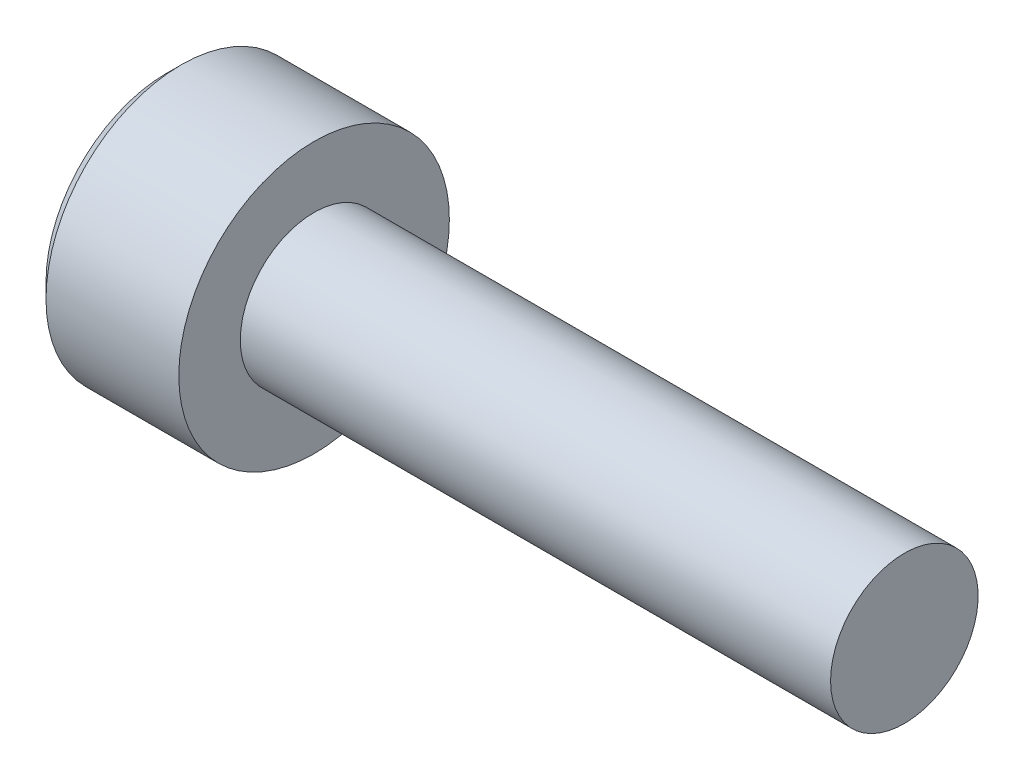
ISO-10303-21;
HEADER;
FILE_DESCRIPTION(('STEP AP214'),'2;1');
FILE_NAME('part.step','',(''),(''),'','','');
FILE_SCHEMA(('AUTOMOTIVE_DESIGN { 1 0 10303 214 1 1 1 1 }'));
ENDSEC;
DATA;
#1=APPLICATION_CONTEXT('core data for automotive mechanical design processes');
#2=APPLICATION_PROTOCOL_DEFINITION('international standard','automotive_design',2000,#1);
#3=PRODUCT_CONTEXT('',#1,'mechanical');
#4=PRODUCT('Part','Part','',(#3));
#5=PRODUCT_RELATED_PRODUCT_CATEGORY('part','',(#4));
#6=PRODUCT_DEFINITION_FORMATION('','',#4);
#7=PRODUCT_DEFINITION_CONTEXT('part definition',#1,'design');
#8=PRODUCT_DEFINITION('design','',#6,#7);
#9=PRODUCT_DEFINITION_SHAPE('','',#8);
#10=(LENGTH_UNIT() NAMED_UNIT(*) SI_UNIT(.MILLI.,.METRE.));
#11=(NAMED_UNIT(*) PLANE_ANGLE_UNIT() SI_UNIT($,.RADIAN.));
#12=(NAMED_UNIT(*) SI_UNIT($,.STERADIAN.) SOLID_ANGLE_UNIT());
#13=UNCERTAINTY_MEASURE_WITH_UNIT(LENGTH_MEASURE(1.E-05),#10,'distance_accuracy_value','');
#14=(GEOMETRIC_REPRESENTATION_CONTEXT(3) GLOBAL_UNCERTAINTY_ASSIGNED_CONTEXT((#13)) GLOBAL_UNIT_ASSIGNED_CONTEXT((#10,
#11,#12)) REPRESENTATION_CONTEXT('',''));
#15=CARTESIAN_POINT('',(0.,0.,0.));
#16=DIRECTION('',(0.,0.,1.));
#17=DIRECTION('',(1.,0.,0.));
#18=AXIS2_PLACEMENT_3D('',#15,#16,#17);
#19=CARTESIAN_POINT('',(-3.,2.75,0.));
#20=DIRECTION('',(1.,0.,0.));
#21=DIRECTION('',(0.,0.,-1.));
#22=AXIS2_PLACEMENT_3D('',#19,#20,#21);
#23=PLANE('',#22);
#24=CARTESIAN_POINT('',(-3.,0.,0.));
#25=DIRECTION('',(1.,0.,0.));
#26=DIRECTION('',(0.,0.,-1.));
#27=AXIS2_PLACEMENT_3D('',#24,#25,#26);
#28=CIRCLE('',#27,2.45);
#29=CARTESIAN_POINT('',(-3.,0.,-2.45));
#30=VERTEX_POINT('',#29);
#31=EDGE_CURVE('E45',#30,#30,#28,.F.);
#32=ORIENTED_EDGE('',*,*,#31,.T.);
#33=EDGE_LOOP('',(#32));
#34=FACE_BOUND('',#33,.T.);
#35=DIRECTION('',(0.,0.5,0.866025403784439));
#36=VECTOR('',#35,1.);
#37=CARTESIAN_POINT('',(-3.,-1.44337567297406,0.));
#38=LINE('',#37,#36);
#39=CARTESIAN_POINT('',(-3.,-1.44337567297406,0.));
#40=VERTEX_POINT('',#39);
#41=CARTESIAN_POINT('',(-3.,-0.721687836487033,1.25));
#42=VERTEX_POINT('',#41);
#43=EDGE_CURVE('E152',#40,#42,#38,.T.);
#44=ORIENTED_EDGE('',*,*,#43,.F.);
#45=DIRECTION('',(0.,-0.5,0.866025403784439));
#46=VECTOR('',#45,1.);
#47=CARTESIAN_POINT('',(-3.,-0.721687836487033,-1.25));
#48=LINE('',#47,#46);
#49=CARTESIAN_POINT('',(-3.,-0.721687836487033,-1.25));
#50=VERTEX_POINT('',#49);
#51=EDGE_CURVE('E52',#50,#40,#48,.T.);
#52=ORIENTED_EDGE('',*,*,#51,.F.);
#53=DIRECTION('',(0.,-1.,0.));
#54=VECTOR('',#53,1.);
#55=CARTESIAN_POINT('',(-3.,0.721687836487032,-1.25));
#56=LINE('',#55,#54);
#57=CARTESIAN_POINT('',(-3.,0.721687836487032,-1.25));
#58=VERTEX_POINT('',#57);
#59=EDGE_CURVE('E122',#58,#50,#56,.T.);
#60=ORIENTED_EDGE('',*,*,#59,.F.);
#61=DIRECTION('',(0.,-0.5,-0.866025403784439));
#62=VECTOR('',#61,1.);
#63=CARTESIAN_POINT('',(-3.,1.44337567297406,0.));
#64=LINE('',#63,#62);
#65=CARTESIAN_POINT('',(-3.,1.44337567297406,0.));
#66=VERTEX_POINT('',#65);
#67=EDGE_CURVE('E158',#66,#58,#64,.T.);
#68=ORIENTED_EDGE('',*,*,#67,.F.);
#69=DIRECTION('',(0.,0.5,-0.866025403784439));
#70=VECTOR('',#69,1.);
#71=CARTESIAN_POINT('',(-3.,0.721687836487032,1.25));
#72=LINE('',#71,#70);
#73=CARTESIAN_POINT('',(-3.,0.721687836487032,1.25));
#74=VERTEX_POINT('',#73);
#75=EDGE_CURVE('E156',#74,#66,#72,.T.);
#76=ORIENTED_EDGE('',*,*,#75,.F.);
#77=DIRECTION('',(0.,1.,0.));
#78=VECTOR('',#77,1.);
#79=CARTESIAN_POINT('',(-3.,-0.721687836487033,1.25));
#80=LINE('',#79,#78);
#81=EDGE_CURVE('E154',#42,#74,#80,.T.);
#82=ORIENTED_EDGE('',*,*,#81,.F.);
#83=EDGE_LOOP('',(#44,#52,#60,#68,#76,#82));
#84=FACE_BOUND('',#83,.T.);
#85=ADVANCED_FACE('F37',(#34,#84),#23,.F.);
#86=CARTESIAN_POINT('',(12.,0.,0.));
#87=DIRECTION('',(-1.,0.,0.));
#88=DIRECTION('',(0.,0.,1.));
#89=AXIS2_PLACEMENT_3D('',#86,#87,#88);
#90=PLANE('',#89);
#91=CARTESIAN_POINT('',(12.,0.,0.));
#92=DIRECTION('',(-1.,0.,0.));
#93=DIRECTION('',(0.,0.,1.));
#94=AXIS2_PLACEMENT_3D('',#91,#92,#93);
#95=CIRCLE('',#94,1.5);
#96=CARTESIAN_POINT('',(12.,0.,1.5));
#97=VERTEX_POINT('',#96);
#98=EDGE_CURVE('E184',#97,#97,#95,.T.);
#99=ORIENTED_EDGE('',*,*,#98,.F.);
#100=EDGE_LOOP('',(#99));
#101=FACE_BOUND('',#100,.T.);
#102=ADVANCED_FACE('F205',(#101),#90,.F.);
#103=CARTESIAN_POINT('',(-3.,0.,0.));
#104=DIRECTION('',(-1.,0.,0.));
#105=DIRECTION('',(0.,0.,1.));
#106=AXIS2_PLACEMENT_3D('',#103,#104,#105);
#107=CYLINDRICAL_SURFACE('',#106,1.5);
#108=CARTESIAN_POINT('',(0.,0.,0.));
#109=DIRECTION('',(-1.,0.,0.));
#110=DIRECTION('',(0.,0.,1.));
#111=AXIS2_PLACEMENT_3D('',#108,#109,#110);
#112=CIRCLE('',#111,1.5);
#113=CARTESIAN_POINT('',(0.,0.,1.5));
#114=VERTEX_POINT('',#113);
#115=EDGE_CURVE('E181',#114,#114,#112,.T.);
#116=ORIENTED_EDGE('',*,*,#115,.F.);
#117=EDGE_LOOP('',(#116));
#118=FACE_BOUND('',#117,.T.);
#119=ORIENTED_EDGE('',*,*,#98,.T.);
#120=EDGE_LOOP('',(#119));
#121=FACE_BOUND('',#120,.T.);
#122=ADVANCED_FACE('F209',(#118,#121),#107,.T.);
#123=CARTESIAN_POINT('',(0.,1.5,0.));
#124=DIRECTION('',(-1.,0.,0.));
#125=DIRECTION('',(0.,0.,1.));
#126=AXIS2_PLACEMENT_3D('',#123,#124,#125);
#127=PLANE('',#126);
#128=CARTESIAN_POINT('',(0.,0.,0.));
#129=DIRECTION('',(-1.,0.,0.));
#130=DIRECTION('',(0.,0.,1.));
#131=AXIS2_PLACEMENT_3D('',#128,#129,#130);
#132=CIRCLE('',#131,2.75);
#133=CARTESIAN_POINT('',(0.,0.,2.75));
#134=VERTEX_POINT('',#133);
#135=EDGE_CURVE('E177',#134,#134,#132,.T.);
#136=ORIENTED_EDGE('',*,*,#135,.F.);
#137=EDGE_LOOP('',(#136));
#138=FACE_BOUND('',#137,.T.);
#139=ORIENTED_EDGE('',*,*,#115,.T.);
#140=EDGE_LOOP('',(#139));
#141=FACE_BOUND('',#140,.T.);
#142=ADVANCED_FACE('F200',(#138,#141),#127,.F.);
#143=CARTESIAN_POINT('',(-3.,0.,0.));
#144=DIRECTION('',(-1.,0.,0.));
#145=DIRECTION('',(0.,0.,1.));
#146=AXIS2_PLACEMENT_3D('',#143,#144,#145);
#147=CYLINDRICAL_SURFACE('',#146,2.75);
#148=CARTESIAN_POINT('',(-2.7,0.,0.));
#149=DIRECTION('',(1.,0.,0.));
#150=DIRECTION('',(0.,0.,-1.));
#151=AXIS2_PLACEMENT_3D('',#148,#149,#150);
#152=CIRCLE('',#151,2.75);
#153=CARTESIAN_POINT('',(-2.7,0.,-2.75));
#154=VERTEX_POINT('',#153);
#155=EDGE_CURVE('E11',#154,#154,#152,.T.);
#156=ORIENTED_EDGE('',*,*,#155,.T.);
#157=EDGE_LOOP('',(#156));
#158=FACE_BOUND('',#157,.T.);
#159=ORIENTED_EDGE('',*,*,#135,.T.);
#160=EDGE_LOOP('',(#159));
#161=FACE_BOUND('',#160,.T.);
#162=ADVANCED_FACE('F192',(#158,#161),#147,.T.);
#163=CARTESIAN_POINT('',(-3.,0.,0.));
#164=DIRECTION('',(1.,0.,0.));
#165=DIRECTION('',(0.,0.,-1.));
#166=AXIS2_PLACEMENT_3D('',#163,#164,#165);
#167=CONICAL_SURFACE('',#166,2.45,0.78539816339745);
#168=ORIENTED_EDGE('',*,*,#155,.F.);
#169=EDGE_LOOP('',(#168));
#170=FACE_BOUND('',#169,.T.);
#171=ORIENTED_EDGE('',*,*,#31,.F.);
#172=EDGE_LOOP('',(#171));
#173=FACE_BOUND('',#172,.T.);
#174=ADVANCED_FACE('F39',(#170,#173),#167,.T.);
#175=CARTESIAN_POINT('',(-1.7,-0.721687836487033,-1.25));
#176=DIRECTION('',(0.,-0.866025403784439,-0.5));
#177=DIRECTION('',(0.,0.5,-0.866025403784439));
#178=AXIS2_PLACEMENT_3D('',#175,#176,#177);
#179=PLANE('',#178);
#180=DIRECTION('',(0.,-0.5,0.866025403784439));
#181=VECTOR('',#180,1.);
#182=CARTESIAN_POINT('',(-1.7,-0.721687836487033,-1.25));
#183=LINE('',#182,#181);
#184=CARTESIAN_POINT('',(-1.7,-0.721687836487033,-1.25));
#185=VERTEX_POINT('',#184);
#186=CARTESIAN_POINT('',(-1.7,-1.08253175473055,-0.625));
#187=VERTEX_POINT('',#186);
#188=EDGE_CURVE('E121',#185,#187,#183,.T.);
#189=ORIENTED_EDGE('',*,*,#188,.F.);
#190=DIRECTION('',(-1.,0.,0.));
#191=VECTOR('',#190,1.);
#192=CARTESIAN_POINT('',(-1.7,-0.721687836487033,-1.25));
#193=LINE('',#192,#191);
#194=EDGE_CURVE('E161',#185,#50,#193,.T.);
#195=ORIENTED_EDGE('',*,*,#194,.T.);
#196=ORIENTED_EDGE('',*,*,#51,.T.);
#197=DIRECTION('',(-1.,0.,0.));
#198=VECTOR('',#197,1.);
#199=CARTESIAN_POINT('',(-1.7,-1.44337567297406,0.));
#200=LINE('',#199,#198);
#201=CARTESIAN_POINT('',(-1.7,-1.44337567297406,0.));
#202=VERTEX_POINT('',#201);
#203=EDGE_CURVE('E124',#202,#40,#200,.T.);
#204=ORIENTED_EDGE('',*,*,#203,.F.);
#205=EDGE_CURVE('E113',#187,#202,#183,.T.);
#206=ORIENTED_EDGE('',*,*,#205,.F.);
#207=EDGE_LOOP('',(#189,#195,#196,#204,#206));
#208=FACE_BOUND('',#207,.T.);
#209=ADVANCED_FACE('F125',(#208),#179,.F.);
#210=CARTESIAN_POINT('',(-1.7,0.721687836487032,-1.25));
#211=DIRECTION('',(0.,0.,-1.));
#212=DIRECTION('',(0.,1.,0.));
#213=AXIS2_PLACEMENT_3D('',#210,#211,#212);
#214=PLANE('',#213);
#215=DIRECTION('',(0.,-1.,0.));
#216=VECTOR('',#215,1.);
#217=CARTESIAN_POINT('',(-1.7,0.721687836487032,-1.25));
#218=LINE('',#217,#216);
#219=CARTESIAN_POINT('',(-1.7,0.721687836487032,-1.25));
#220=VERTEX_POINT('',#219);
#221=CARTESIAN_POINT('',(-1.7,0.,-1.25));
#222=VERTEX_POINT('',#221);
#223=EDGE_CURVE('E130',#220,#222,#218,.T.);
#224=ORIENTED_EDGE('',*,*,#223,.F.);
#225=DIRECTION('',(-1.,0.,0.));
#226=VECTOR('',#225,1.);
#227=CARTESIAN_POINT('',(-1.7,0.721687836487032,-1.25));
#228=LINE('',#227,#226);
#229=EDGE_CURVE('E163',#220,#58,#228,.T.);
#230=ORIENTED_EDGE('',*,*,#229,.T.);
#231=ORIENTED_EDGE('',*,*,#59,.T.);
#232=ORIENTED_EDGE('',*,*,#194,.F.);
#233=EDGE_CURVE('E148',#222,#185,#218,.T.);
#234=ORIENTED_EDGE('',*,*,#233,.F.);
#235=EDGE_LOOP('',(#224,#230,#231,#232,#234));
#236=FACE_BOUND('',#235,.T.);
#237=ADVANCED_FACE('F198',(#236),#214,.F.);
#238=CARTESIAN_POINT('',(-1.7,1.44337567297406,0.));
#239=DIRECTION('',(0.,0.866025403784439,-0.5));
#240=DIRECTION('',(0.,0.5,0.866025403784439));
#241=AXIS2_PLACEMENT_3D('',#238,#239,#240);
#242=PLANE('',#241);
#243=DIRECTION('',(0.,-0.5,-0.866025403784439));
#244=VECTOR('',#243,1.);
#245=CARTESIAN_POINT('',(-1.7,1.44337567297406,0.));
#246=LINE('',#245,#244);
#247=CARTESIAN_POINT('',(-1.7,1.44337567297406,0.));
#248=VERTEX_POINT('',#247);
#249=CARTESIAN_POINT('',(-1.7,1.08253175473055,-0.625));
#250=VERTEX_POINT('',#249);
#251=EDGE_CURVE('E145',#248,#250,#246,.T.);
#252=ORIENTED_EDGE('',*,*,#251,.F.);
#253=DIRECTION('',(-1.,0.,0.));
#254=VECTOR('',#253,1.);
#255=CARTESIAN_POINT('',(-1.7,1.44337567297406,0.));
#256=LINE('',#255,#254);
#257=EDGE_CURVE('E166',#248,#66,#256,.T.);
#258=ORIENTED_EDGE('',*,*,#257,.T.);
#259=ORIENTED_EDGE('',*,*,#67,.T.);
#260=ORIENTED_EDGE('',*,*,#229,.F.);
#261=EDGE_CURVE('E144',#250,#220,#246,.T.);
#262=ORIENTED_EDGE('',*,*,#261,.F.);
#263=EDGE_LOOP('',(#252,#258,#259,#260,#262));
#264=FACE_BOUND('',#263,.T.);
#265=ADVANCED_FACE('F234',(#264),#242,.F.);
#266=CARTESIAN_POINT('',(-1.7,0.721687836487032,1.25));
#267=DIRECTION('',(0.,0.866025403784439,0.5));
#268=DIRECTION('',(0.,-0.5,0.866025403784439));
#269=AXIS2_PLACEMENT_3D('',#266,#267,#268);
#270=PLANE('',#269);
#271=DIRECTION('',(0.,0.5,-0.866025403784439));
#272=VECTOR('',#271,1.);
#273=CARTESIAN_POINT('',(-1.7,0.721687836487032,1.25));
#274=LINE('',#273,#272);
#275=CARTESIAN_POINT('',(-1.7,0.721687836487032,1.25));
#276=VERTEX_POINT('',#275);
#277=CARTESIAN_POINT('',(-1.7,1.08253175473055,0.624999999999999));
#278=VERTEX_POINT('',#277);
#279=EDGE_CURVE('E141',#276,#278,#274,.T.);
#280=ORIENTED_EDGE('',*,*,#279,.F.);
#281=DIRECTION('',(-1.,0.,0.));
#282=VECTOR('',#281,1.);
#283=CARTESIAN_POINT('',(-1.7,0.721687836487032,1.25));
#284=LINE('',#283,#282);
#285=EDGE_CURVE('E169',#276,#74,#284,.T.);
#286=ORIENTED_EDGE('',*,*,#285,.T.);
#287=ORIENTED_EDGE('',*,*,#75,.T.);
#288=ORIENTED_EDGE('',*,*,#257,.F.);
#289=EDGE_CURVE('E140',#278,#248,#274,.T.);
#290=ORIENTED_EDGE('',*,*,#289,.F.);
#291=EDGE_LOOP('',(#280,#286,#287,#288,#290));
#292=FACE_BOUND('',#291,.T.);
#293=ADVANCED_FACE('F230',(#292),#270,.F.);
#294=CARTESIAN_POINT('',(-1.7,-0.721687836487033,1.25));
#295=DIRECTION('',(0.,0.,1.));
#296=DIRECTION('',(1.,0.,0.));
#297=AXIS2_PLACEMENT_3D('',#294,#295,#296);
#298=PLANE('',#297);
#299=DIRECTION('',(0.,1.,0.));
#300=VECTOR('',#299,1.);
#301=CARTESIAN_POINT('',(-1.7,-0.721687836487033,1.25));
#302=LINE('',#301,#300);
#303=CARTESIAN_POINT('',(-1.7,-0.721687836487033,1.25));
#304=VERTEX_POINT('',#303);
#305=CARTESIAN_POINT('',(-1.7,0.,1.25));
#306=VERTEX_POINT('',#305);
#307=EDGE_CURVE('E60',#304,#306,#302,.T.);
#308=ORIENTED_EDGE('',*,*,#307,.F.);
#309=DIRECTION('',(-1.,0.,0.));
#310=VECTOR('',#309,1.);
#311=CARTESIAN_POINT('',(-1.7,-0.721687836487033,1.25));
#312=LINE('',#311,#310);
#313=EDGE_CURVE('E129',#304,#42,#312,.T.);
#314=ORIENTED_EDGE('',*,*,#313,.T.);
#315=ORIENTED_EDGE('',*,*,#81,.T.);
#316=ORIENTED_EDGE('',*,*,#285,.F.);
#317=EDGE_CURVE('E136',#306,#276,#302,.T.);
#318=ORIENTED_EDGE('',*,*,#317,.F.);
#319=EDGE_LOOP('',(#308,#314,#315,#316,#318));
#320=FACE_BOUND('',#319,.T.);
#321=ADVANCED_FACE('F227',(#320),#298,.F.);
#322=CARTESIAN_POINT('',(-1.7,-1.44337567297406,0.));
#323=DIRECTION('',(0.,-0.866025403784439,0.5));
#324=DIRECTION('',(0.,-0.5,-0.866025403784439));
#325=AXIS2_PLACEMENT_3D('',#322,#323,#324);
#326=PLANE('',#325);
#327=DIRECTION('',(0.,0.5,0.866025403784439));
#328=VECTOR('',#327,1.);
#329=CARTESIAN_POINT('',(-1.7,-1.44337567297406,0.));
#330=LINE('',#329,#328);
#331=CARTESIAN_POINT('',(-1.7,-1.08253175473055,0.625));
#332=VERTEX_POINT('',#331);
#333=EDGE_CURVE('E116',#202,#332,#330,.T.);
#334=ORIENTED_EDGE('',*,*,#333,.F.);
#335=ORIENTED_EDGE('',*,*,#203,.T.);
#336=ORIENTED_EDGE('',*,*,#43,.T.);
#337=ORIENTED_EDGE('',*,*,#313,.F.);
#338=EDGE_CURVE('E135',#332,#304,#330,.T.);
#339=ORIENTED_EDGE('',*,*,#338,.F.);
#340=EDGE_LOOP('',(#334,#335,#336,#337,#339));
#341=FACE_BOUND('',#340,.T.);
#342=ADVANCED_FACE('F133',(#341),#326,.F.);
#343=CARTESIAN_POINT('',(-1.7,0.,0.));
#344=DIRECTION('',(-1.,0.,0.));
#345=DIRECTION('',(0.,0.,1.));
#346=AXIS2_PLACEMENT_3D('',#343,#344,#345);
#347=PLANE('',#346);
#348=ORIENTED_EDGE('',*,*,#317,.T.);
#349=ORIENTED_EDGE('',*,*,#279,.T.);
#350=CARTESIAN_POINT('',(-1.7,0.,0.));
#351=DIRECTION('',(-1.,0.,0.));
#352=DIRECTION('',(0.,-1.,0.));
#353=AXIS2_PLACEMENT_3D('',#350,#351,#352);
#354=CIRCLE('',#353,1.25);
#355=EDGE_CURVE('E178',#306,#278,#354,.T.);
#356=ORIENTED_EDGE('',*,*,#355,.F.);
#357=EDGE_LOOP('',(#348,#349,#356));
#358=FACE_BOUND('',#357,.T.);
#359=ADVANCED_FACE('F226',(#358),#347,.T.);
#360=ORIENTED_EDGE('',*,*,#289,.T.);
#361=ORIENTED_EDGE('',*,*,#251,.T.);
#362=EDGE_CURVE('E264',#278,#250,#354,.T.);
#363=ORIENTED_EDGE('',*,*,#362,.F.);
#364=EDGE_LOOP('',(#360,#361,#363));
#365=FACE_BOUND('',#364,.T.);
#366=ADVANCED_FACE('F248',(#365),#347,.T.);
#367=ORIENTED_EDGE('',*,*,#261,.T.);
#368=ORIENTED_EDGE('',*,*,#223,.T.);
#369=EDGE_CURVE('E266',#250,#222,#354,.T.);
#370=ORIENTED_EDGE('',*,*,#369,.F.);
#371=EDGE_LOOP('',(#367,#368,#370));
#372=FACE_BOUND('',#371,.T.);
#373=ADVANCED_FACE('F253',(#372),#347,.T.);
#374=ORIENTED_EDGE('',*,*,#233,.T.);
#375=ORIENTED_EDGE('',*,*,#188,.T.);
#376=EDGE_CURVE('E267',#222,#187,#354,.T.);
#377=ORIENTED_EDGE('',*,*,#376,.F.);
#378=EDGE_LOOP('',(#374,#375,#377));
#379=FACE_BOUND('',#378,.T.);
#380=ADVANCED_FACE('F246',(#379),#347,.T.);
#381=ORIENTED_EDGE('',*,*,#205,.T.);
#382=ORIENTED_EDGE('',*,*,#333,.T.);
#383=EDGE_CURVE('E118',#187,#332,#354,.T.);
#384=ORIENTED_EDGE('',*,*,#383,.F.);
#385=EDGE_LOOP('',(#381,#382,#384));
#386=FACE_BOUND('',#385,.T.);
#387=ADVANCED_FACE('F114',(#386),#347,.T.);
#388=ORIENTED_EDGE('',*,*,#338,.T.);
#389=ORIENTED_EDGE('',*,*,#307,.T.);
#390=EDGE_CURVE('E174',#332,#306,#354,.T.);
#391=ORIENTED_EDGE('',*,*,#390,.F.);
#392=EDGE_LOOP('',(#388,#389,#391));
#393=FACE_BOUND('',#392,.T.);
#394=ADVANCED_FACE('F221',(#393),#347,.T.);
#395=CARTESIAN_POINT('',(-0.948924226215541,0.,0.));
#396=DIRECTION('',(-1.,0.,0.));
#397=DIRECTION('',(0.,-1.,0.));
#398=AXIS2_PLACEMENT_3D('',#395,#396,#397);
#399=CONICAL_SURFACE('',#398,0.,1.02974425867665);
#400=ORIENTED_EDGE('',*,*,#390,.T.);
#401=ORIENTED_EDGE('',*,*,#355,.T.);
#402=ORIENTED_EDGE('',*,*,#362,.T.);
#403=ORIENTED_EDGE('',*,*,#369,.T.);
#404=ORIENTED_EDGE('',*,*,#376,.T.);
#405=ORIENTED_EDGE('',*,*,#383,.T.);
#406=EDGE_LOOP('',(#400,#401,#402,#403,#404,#405));
#407=FACE_BOUND('',#406,.T.);
#408=CARTESIAN_POINT('',(-0.948924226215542,0.,0.));
#409=VERTEX_POINT('',#408);
#410=VERTEX_LOOP('',#409);
#411=FACE_BOUND('',#410,.T.);
#412=ADVANCED_FACE('F219',(#407,#411),#399,.F.);
#413=CLOSED_SHELL('',(#85,#102,#122,#142,#162,#174,#209,#237,#265,#293,#321,#342,#359,#366,#373,
#380,#387,#394,#412));
#414=MANIFOLD_SOLID_BREP('B2',#413);
#415=ADVANCED_BREP_SHAPE_REPRESENTATION('',(#18,#414),#14);
#416=SHAPE_DEFINITION_REPRESENTATION(#9,#415);
ENDSEC;
END-ISO-10303-21;
